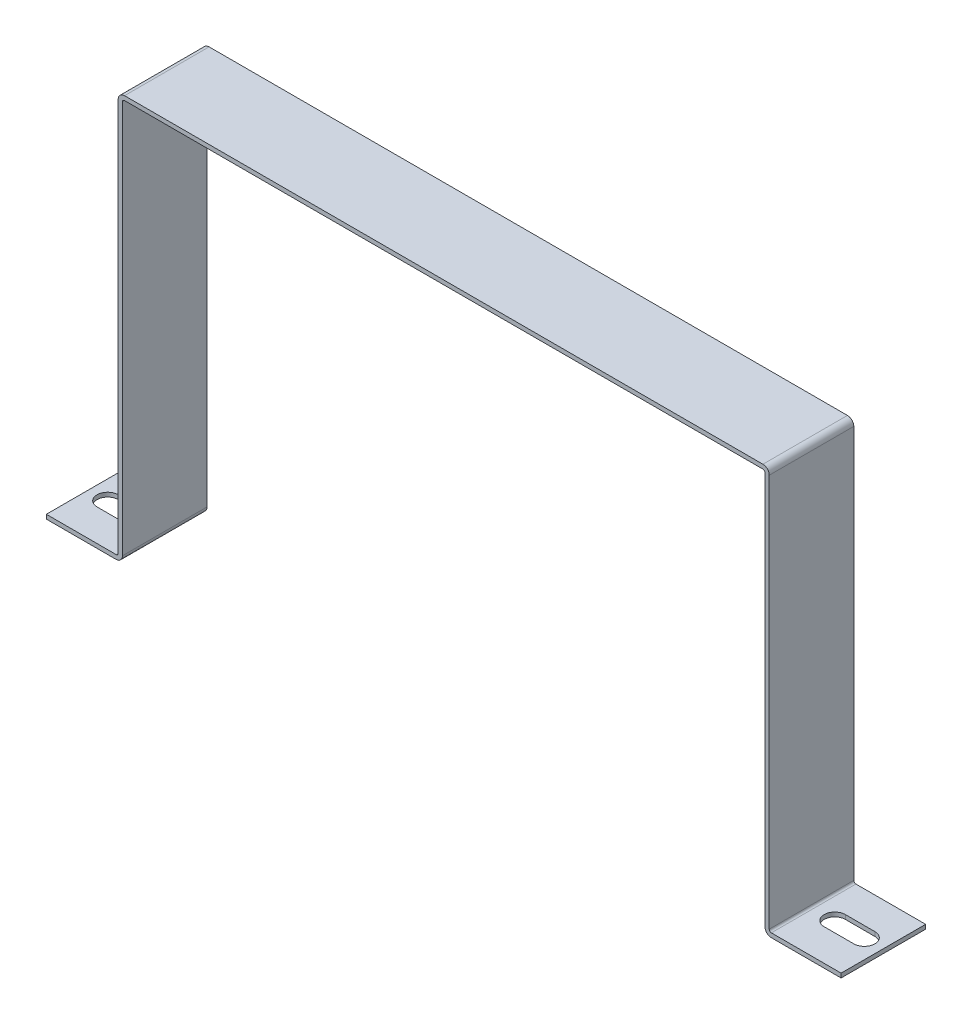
from build123d import *

# Parameters (mm, degrees)
EXTRUSION1_DEPTH        = 20
ENL_V_MAT_EXTRU_1_DEPTH = 136.838138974


with BuildPart() as part:
    # Esquisse1 → Extrusion1 (new body)
    with BuildSketch(Plane.XY):
        with BuildLine():
            Line((75.5, 95), (-75.5, 95))
            ThreePointArc((-75.5, 95), (-75.853553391, 94.853553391), (-76, 94.5))
            Line((-76, 94.5), (-76, 1.5))
            ThreePointArc((-76, 1.5), (-76.439339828, 0.439339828), (-77.5, 0))
            Line((-77.5, 0), (-94, 0))
            Line((-94, 0), (-94, 1))
            Line((-94, 1), (-77.5, 1))
            ThreePointArc((-77.5, 1), (-77.146446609, 1.146446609), (-77, 1.5))
            Line((-77, 1.5), (-77, 94.5))
            ThreePointArc((-77, 94.5), (-76.560660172, 95.560660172), (-75.5, 96))
            Line((-75.5, 96), (75.5, 96))
            ThreePointArc((75.5, 96), (76.560660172, 95.560660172), (77, 94.5))
            Line((77, 94.5), (77, 1.5))
            ThreePointArc((77, 1.5), (77.146446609, 1.146446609), (77.5, 1))
            Line((77.5, 1), (94, 1))
            Line((94, 1), (94, 0))
            Line((94, 0), (77.5, 0))
            ThreePointArc((77.5, 0), (76.439339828, 0.439339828), (76, 1.5))
            Line((76, 1.5), (76, 94.5))
            ThreePointArc((76, 94.5), (75.853553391, 94.853553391), (75.5, 95))
        make_face()
    extrude(amount=EXTRUSION1_DEPTH)

    # Esquisse2 → Enl_v. mat.-Extru.1 (cut, through all)
    with BuildSketch(Plane.XZ):
        with BuildLine():
            Line((-89.5, 12.5), (-82.5, 12.5))
            ThreePointArc((-82.5, 12.5), (-80, 10), (-82.5, 7.5))
            Line((-82.5, 7.5), (-89.5, 7.5))
            ThreePointArc((-89.5, 7.5), (-92, 10), (-89.5, 12.5))
        make_face()
        with BuildLine():
            Line((89.5, 7.5), (82.5, 7.5))
            ThreePointArc((82.5, 7.5), (80, 10), (82.5, 12.5))
            Line((82.5, 12.5), (89.5, 12.5))
            ThreePointArc((89.5, 12.5), (92, 10), (89.5, 7.5))
        make_face()
    extrude(amount=-ENL_V_MAT_EXTRU_1_DEPTH, mode=Mode.SUBTRACT)


solid = part.part
